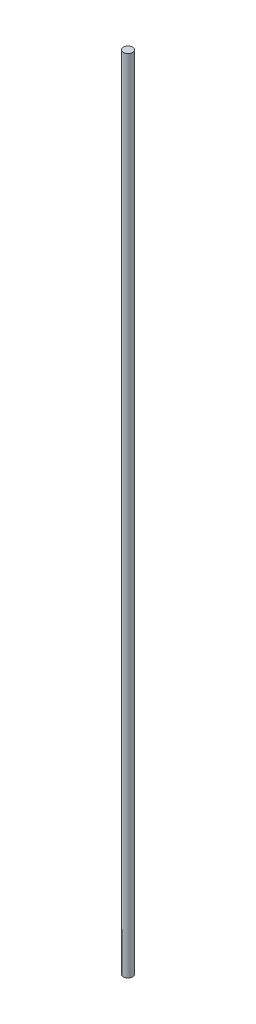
from build123d import *

# Parameters (mm, degrees)
SKETCH1_R           = 0.875
BOSS_EXTRUDE1_DEPTH = 152.4


with BuildPart() as part:
    # Sketch1 → Boss-Extrude1 (new body)
    with BuildSketch(Plane(origin=(0, 0, 0), x_dir=(1, 0, 0), z_dir=(0, 1, 0))):
        with Locations(Location((0, 0, 0), (0, 0, 90))):
            Circle(SKETCH1_R)
    extrude(amount=BOSS_EXTRUDE1_DEPTH)


solid = part.part
